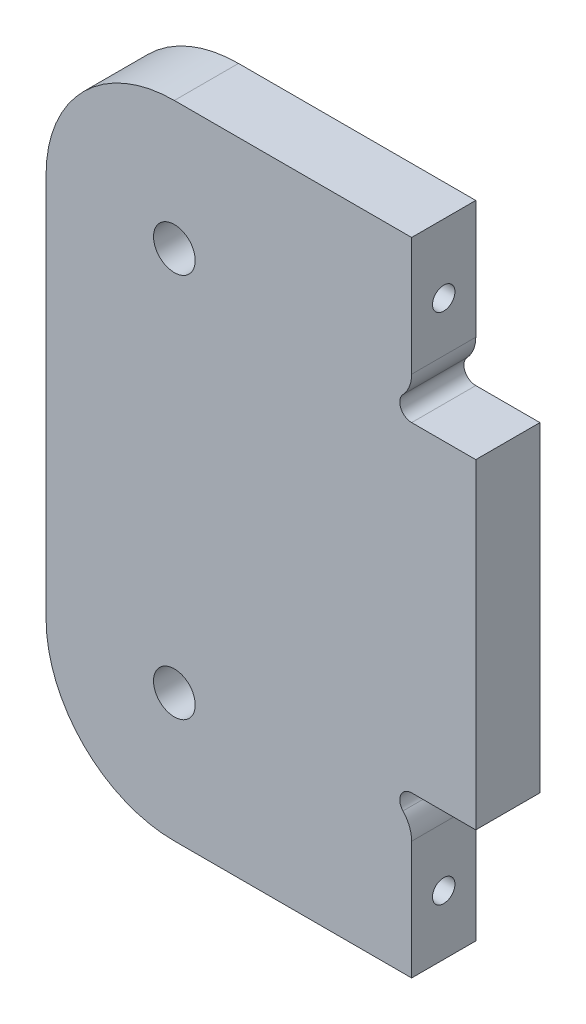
from build123d import *

# Parameters (mm, degrees)
ESQUISSE1_R                         = 3.25
BOSS_EXTRU_1_DEPTH                  = 10
DIAM_TRE_DU_PER_AGE_3_5_3_5_1_D     = 3.5
DIAM_TRE_DU_PER_AGE_3_5_3_5_1_DEPTH = 14
DIAM_TRE_DU_PER_AGE_3_5_3_5_1_TIP   = 1.051506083


with BuildPart() as part:
    # Esquisse1 → Boss.-Extru.1 (new body)
    with BuildSketch(Plane.XY):
        with BuildLine():
            Line((22.647208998, -24.305787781), (32.647208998, -24.305787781))
            Line((32.647208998, -24.305787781), (32.647208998, 25.694212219))
            Line((32.647208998, 25.694212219), (22.647208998, 25.694212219))
            ThreePointArc((22.647208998, 25.694212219), (20.949878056, 26.808299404), (21.296844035, 28.808733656))
            ThreePointArc((21.296844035, 28.808733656), (22.297379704, 30.388993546), (22.647208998, 32.226359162))
            Line((22.647208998, 32.226359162), (22.647208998, 50.694212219))
            Line((22.647208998, 50.694212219), (-14.352791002, 50.694212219))
            ThreePointArc((-14.352791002, 50.694212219), (-28.494926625, 44.836347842), (-34.352791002, 30.694212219))
            Line((-34.352791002, 30.694212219), (-34.352791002, -29.305787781))
            ThreePointArc((-34.352791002, -29.305787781), (-28.494926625, -43.447923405), (-14.352791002, -49.305787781))
            Line((-14.352791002, -49.305787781), (22.647208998, -49.305787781))
            Line((22.647208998, -49.305787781), (22.647208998, -30.837934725))
            ThreePointArc((22.647208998, -30.837934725), (22.297379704, -29.000569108), (21.296844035, -27.420309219))
            ThreePointArc((21.296844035, -27.420309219), (20.949878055, -25.419874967), (22.647208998, -24.305787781))
        make_face()
        with Locations((-14.352791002, -29.305787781)):
            Circle(ESQUISSE1_R, mode=Mode.SUBTRACT)
        with Locations((-14.352791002, 30.694212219)):
            Circle(ESQUISSE1_R, mode=Mode.SUBTRACT)
    extrude(amount=BOSS_EXTRU_1_DEPTH)

    # Diam_tre du per_age _3.5 _3.5_1
    with Locations(Plane(origin=(22.647208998, 0, 0), x_dir=(0, 0, -1), z_dir=(1, 0, 0))):
        with Locations((-5, 40), (-5, -40.002183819)):
            Hole(DIAM_TRE_DU_PER_AGE_3_5_3_5_1_D / 2, depth=DIAM_TRE_DU_PER_AGE_3_5_3_5_1_DEPTH)
            with Locations((0, 0, -(DIAM_TRE_DU_PER_AGE_3_5_3_5_1_DEPTH + DIAM_TRE_DU_PER_AGE_3_5_3_5_1_TIP / 2))):  # 118° drill point
                Cone(0, DIAM_TRE_DU_PER_AGE_3_5_3_5_1_D / 2, DIAM_TRE_DU_PER_AGE_3_5_3_5_1_TIP, mode=Mode.SUBTRACT)


solid = part.part
